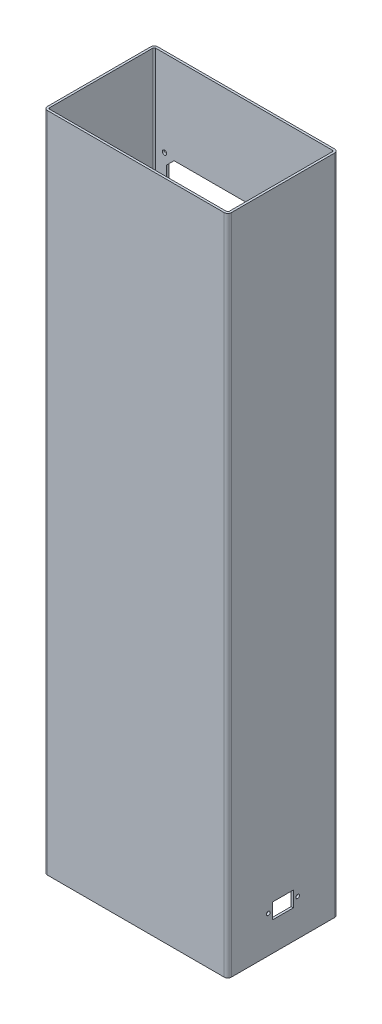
from build123d import *

# Parameters (mm, degrees)
ESQUISSE1_W             = 250
ESQUISSE1_H             = 150
BASE_EXTRUSION_DEPTH    = 900
CONG_2_R                = 5
COQUE1_T                = -3
ENL_V_MAT_EXTRU_2_DEPTH = 10
ESQUISSE4_R             = 3
ENL_V_MAT_EXTRU_3_DEPTH = 10
ESQUISSE6_R             = 2.5
ESQUISSE6_W             = 28
ESQUISSE6_H             = 21
ENL_V_MAT_EXTRU_4_DEPTH = 8


with BuildPart() as part:
    # Esquisse1 → Base-Extrusion (new body)
    with BuildSketch(Plane(origin=(0, 0, 0), x_dir=(1, 0, 0), z_dir=(0, 1, 0))):
        with Locations((125, 75)):
            Rectangle(ESQUISSE1_W, ESQUISSE1_H)
    extrude(amount=BASE_EXTRUSION_DEPTH)

    # Cong_2
    cong_2_edges = [part.edges().sort_by_distance(p)[0] for p in [
        (0, 450, 0),
        (250, 450, 0),
        (250, 450, -150),
        (0, 450, -150),
    ]]
    fillet(cong_2_edges, radius=CONG_2_R)

    # Coque1
    coque1_openings = [part.faces().sort_by_distance(p)[0] for p in [
        (125, 0, -75),
        (125, 900, -75),
    ]]
    offset(amount=COQUE1_T, openings=coque1_openings, kind=Kind.INTERSECTION)

    # Esquisse3 → Enl_v. mat.-Extru.2 (cut)
    with BuildSketch(Plane(origin=(0, 0, -150), x_dir=(-1, 0, 0), z_dir=(0, 0, -1))):
        Polygon((-230, 770), (-220, 780), (-30, 780), (-20, 770), (-20, 460), (-30, 450), (-220, 450), (-230, 460), align=None)
    extrude(amount=-ENL_V_MAT_EXTRU_2_DEPTH, mode=Mode.SUBTRACT)

    # Esquisse4 → Enl_v. mat.-Extru.3 (cut)
    with BuildSketch(Plane(origin=(0, 0, -150), x_dir=(-1, 0, 0), z_dir=(0, 0, -1))):
        with Locations(Location((-17, 783, 0), (0, 0, 90))):
            Circle(ESQUISSE4_R)
        with Locations(Location((-17, 447, 0), (0, 0, 90))):
            Circle(ESQUISSE4_R)
        with Locations(Location((-233, 783, 0), (0, 0, 90))):
            Circle(ESQUISSE4_R)
        with Locations(Location((-233, 447, 0), (0, 0, 90))):
            Circle(ESQUISSE4_R)
    extrude(amount=-ENL_V_MAT_EXTRU_3_DEPTH, mode=Mode.SUBTRACT)

    # Esquisse6 → Enl_v. mat.-Extru.4 (cut)
    with BuildSketch(Plane(origin=(250, 0, 0), x_dir=(0, 0, -1), z_dir=(1, 0, 0))):
        with Locations(Location((95, 50, 0), (0, 0, 90))):
            Circle(ESQUISSE6_R)
        with Locations(Location((55, 50, 0), (0, 0, 90))):
            Circle(ESQUISSE6_R)
        with Locations((75, 50)):
            Rectangle(ESQUISSE6_W, ESQUISSE6_H)
    extrude(amount=-ENL_V_MAT_EXTRU_4_DEPTH, mode=Mode.SUBTRACT)


solid = part.part
